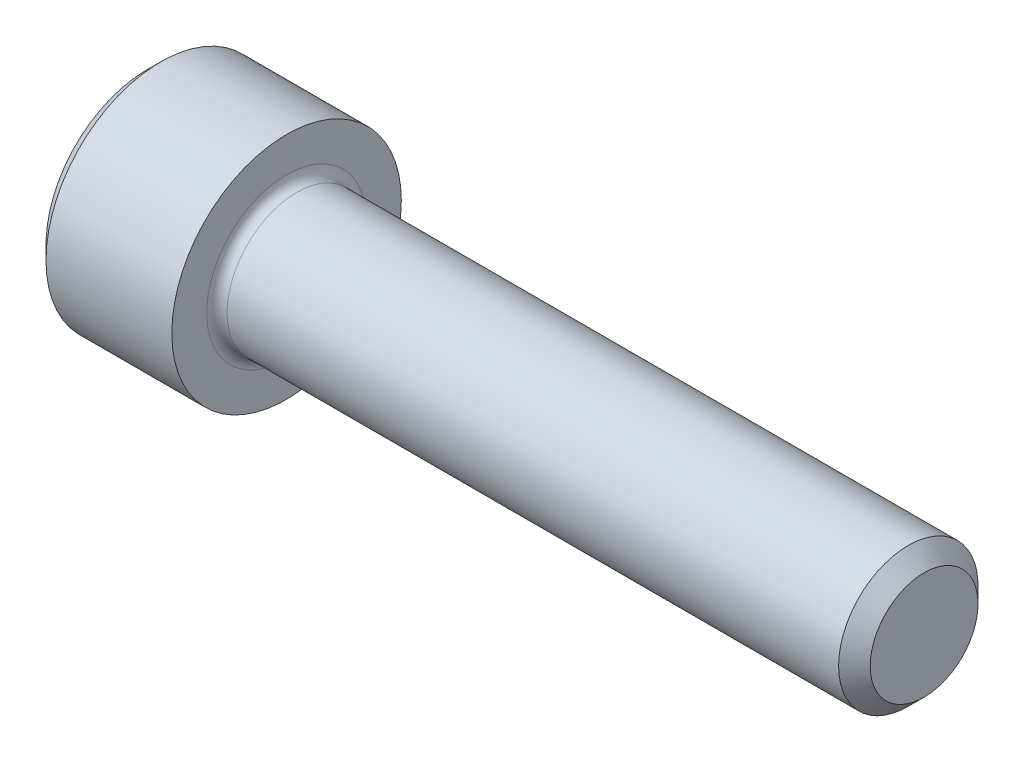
ISO-10303-21;
HEADER;
FILE_DESCRIPTION(('STEP AP214'),'2;1');
FILE_NAME('part.step','',(''),(''),'','','');
FILE_SCHEMA(('AUTOMOTIVE_DESIGN { 1 0 10303 214 1 1 1 1 }'));
ENDSEC;
DATA;
#1=APPLICATION_CONTEXT('core data for automotive mechanical design processes');
#2=APPLICATION_PROTOCOL_DEFINITION('international standard','automotive_design',2000,#1);
#3=PRODUCT_CONTEXT('',#1,'mechanical');
#4=PRODUCT('Part','Part','',(#3));
#5=PRODUCT_RELATED_PRODUCT_CATEGORY('part','',(#4));
#6=PRODUCT_DEFINITION_FORMATION('','',#4);
#7=PRODUCT_DEFINITION_CONTEXT('part definition',#1,'design');
#8=PRODUCT_DEFINITION('design','',#6,#7);
#9=PRODUCT_DEFINITION_SHAPE('','',#8);
#10=(LENGTH_UNIT() NAMED_UNIT(*) SI_UNIT(.MILLI.,.METRE.));
#11=(NAMED_UNIT(*) PLANE_ANGLE_UNIT() SI_UNIT($,.RADIAN.));
#12=(NAMED_UNIT(*) SI_UNIT($,.STERADIAN.) SOLID_ANGLE_UNIT());
#13=UNCERTAINTY_MEASURE_WITH_UNIT(LENGTH_MEASURE(1.E-05),#10,'distance_accuracy_value','');
#14=(GEOMETRIC_REPRESENTATION_CONTEXT(3) GLOBAL_UNCERTAINTY_ASSIGNED_CONTEXT((#13)) GLOBAL_UNIT_ASSIGNED_CONTEXT((#10,
#11,#12)) REPRESENTATION_CONTEXT('',''));
#15=CARTESIAN_POINT('',(0.,0.,0.));
#16=DIRECTION('',(0.,0.,1.));
#17=DIRECTION('',(1.,0.,0.));
#18=AXIS2_PLACEMENT_3D('',#15,#16,#17);
#19=CARTESIAN_POINT('',(0.,0.,0.));
#20=DIRECTION('',(-0.999999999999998,0.,0.));
#21=DIRECTION('',(0.,0.,0.999999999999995));
#22=AXIS2_PLACEMENT_3D('',#19,#20,#21);
#23=PLANE('',#22);
#24=DIRECTION('',(0.,-0.499999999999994,0.866025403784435));
#25=VECTOR('',#24,1.);
#26=CARTESIAN_POINT('',(0.,2.05305755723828,0.));
#27=LINE('',#26,#25);
#28=CARTESIAN_POINT('',(0.,2.05305755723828,0.));
#29=VERTEX_POINT('',#28);
#30=CARTESIAN_POINT('',(0.,1.02652877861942,1.77800000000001));
#31=VERTEX_POINT('',#30);
#32=EDGE_CURVE('E261',#29,#31,#27,.T.);
#33=ORIENTED_EDGE('',*,*,#32,.T.);
#34=DIRECTION('',(0.,0.999999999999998,0.));
#35=VECTOR('',#34,1.);
#36=CARTESIAN_POINT('',(0.,-1.02652877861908,1.77799999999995));
#37=LINE('',#36,#35);
#38=CARTESIAN_POINT('',(0.,-1.02652877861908,1.77799999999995));
#39=VERTEX_POINT('',#38);
#40=EDGE_CURVE('E132',#39,#31,#37,.T.);
#41=ORIENTED_EDGE('',*,*,#40,.F.);
#42=DIRECTION('',(0.,-0.500000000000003,-0.866025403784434));
#43=VECTOR('',#42,1.);
#44=CARTESIAN_POINT('',(0.,-1.02652877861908,1.77799999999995));
#45=LINE('',#44,#43);
#46=CARTESIAN_POINT('',(0.,-2.05305755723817,0.));
#47=VERTEX_POINT('',#46);
#48=EDGE_CURVE('E264',#39,#47,#45,.T.);
#49=ORIENTED_EDGE('',*,*,#48,.T.);
#50=DIRECTION('',(0.,0.499999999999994,-0.866025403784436));
#51=VECTOR('',#50,1.);
#52=CARTESIAN_POINT('',(0.,-2.05305755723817,0.));
#53=LINE('',#52,#51);
#54=CARTESIAN_POINT('',(0.,-1.02652877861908,-1.77799999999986));
#55=VERTEX_POINT('',#54);
#56=EDGE_CURVE('E267',#47,#55,#53,.T.);
#57=ORIENTED_EDGE('',*,*,#56,.T.);
#58=DIRECTION('',(0.,-1.,0.));
#59=VECTOR('',#58,1.);
#60=CARTESIAN_POINT('',(0.,1.02652877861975,-1.77799999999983));
#61=LINE('',#60,#59);
#62=CARTESIAN_POINT('',(0.,1.02652877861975,-1.77799999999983));
#63=VERTEX_POINT('',#62);
#64=EDGE_CURVE('E270',#63,#55,#61,.T.);
#65=ORIENTED_EDGE('',*,*,#64,.F.);
#66=DIRECTION('',(0.,-0.500000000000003,-0.866025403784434));
#67=VECTOR('',#66,1.);
#68=CARTESIAN_POINT('',(0.,2.05305755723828,0.));
#69=LINE('',#68,#67);
#70=EDGE_CURVE('E127',#29,#63,#69,.T.);
#71=ORIENTED_EDGE('',*,*,#70,.F.);
#72=EDGE_LOOP('',(#33,#41,#49,#57,#65,#71));
#73=FACE_BOUND('',#72,.T.);
#74=CARTESIAN_POINT('',(0.,0.,0.));
#75=DIRECTION('',(-0.999999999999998,0.,0.));
#76=DIRECTION('',(0.,0.,0.999999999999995));
#77=AXIS2_PLACEMENT_3D('',#74,#75,#76);
#78=CIRCLE('',#77,3.0226);
#79=CARTESIAN_POINT('',(0.,0.,-3.02259999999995));
#80=VERTEX_POINT('',#79);
#81=EDGE_CURVE('E156',#80,#80,#78,.T.);
#82=ORIENTED_EDGE('',*,*,#81,.T.);
#83=EDGE_LOOP('',(#82));
#84=FACE_BOUND('',#83,.T.);
#85=ADVANCED_FACE('F36',(#73,#84),#23,.T.);
#86=CARTESIAN_POINT('',(0.,0.,0.));
#87=DIRECTION('',(0.999999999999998,0.,0.));
#88=DIRECTION('',(0.,0.,-0.999999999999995));
#89=AXIS2_PLACEMENT_3D('',#86,#87,#88);
#90=CONICAL_SURFACE('',#89,3.0226,0.785398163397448);
#91=CARTESIAN_POINT('',(0.406400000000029,-1.11022302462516E-13,0.));
#92=DIRECTION('',(-0.999999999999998,0.,0.));
#93=DIRECTION('',(0.,0.,0.999999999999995));
#94=AXIS2_PLACEMENT_3D('',#91,#92,#93);
#95=CIRCLE('',#94,3.429);
#96=CARTESIAN_POINT('',(0.406400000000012,0.,-3.42899999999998));
#97=VERTEX_POINT('',#96);
#98=EDGE_CURVE('E153',#97,#97,#95,.T.);
#99=CARTESIAN_POINT('',(0.406400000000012,0.,-3.42899999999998));
#100=CARTESIAN_POINT('',(0.402166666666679,0.,-3.42476666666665));
#101=CARTESIAN_POINT('',(0.397933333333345,0.,-3.42053333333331));
#102=CARTESIAN_POINT('',(0.389466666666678,0.,-3.41206666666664));
#103=CARTESIAN_POINT('',(0.385233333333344,0.,-3.40783333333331));
#104=CARTESIAN_POINT('',(0.376766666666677,0.,-3.39936666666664));
#105=CARTESIAN_POINT('',(0.372533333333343,0.,-3.39513333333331));
#106=CARTESIAN_POINT('',(0.364066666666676,0.,-3.38666666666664));
#107=CARTESIAN_POINT('',(0.359833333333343,0.,-3.38243333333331));
#108=CARTESIAN_POINT('',(0.351366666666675,0.,-3.37396666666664));
#109=CARTESIAN_POINT('',(0.347133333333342,0.,-3.36973333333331));
#110=CARTESIAN_POINT('',(0.338666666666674,0.,-3.36126666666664));
#111=CARTESIAN_POINT('',(0.334433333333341,0.,-3.35703333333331));
#112=CARTESIAN_POINT('',(0.325966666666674,0.,-3.34856666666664));
#113=CARTESIAN_POINT('',(0.32173333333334,0.,-3.34433333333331));
#114=CARTESIAN_POINT('',(0.313266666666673,0.,-3.33586666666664));
#115=CARTESIAN_POINT('',(0.309033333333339,0.,-3.33163333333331));
#116=CARTESIAN_POINT('',(0.300566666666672,0.,-3.32316666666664));
#117=CARTESIAN_POINT('',(0.296333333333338,0.,-3.31893333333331));
#118=CARTESIAN_POINT('',(0.287866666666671,0.,-3.31046666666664));
#119=CARTESIAN_POINT('',(0.283633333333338,0.,-3.30623333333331));
#120=CARTESIAN_POINT('',(0.27516666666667,0.,-3.29776666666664));
#121=CARTESIAN_POINT('',(0.270933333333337,0.,-3.2935333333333));
#122=CARTESIAN_POINT('',(0.262466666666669,0.,-3.28506666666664));
#123=CARTESIAN_POINT('',(0.258233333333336,0.,-3.2808333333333));
#124=CARTESIAN_POINT('',(0.249766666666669,0.,-3.27236666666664));
#125=CARTESIAN_POINT('',(0.245533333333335,0.,-3.2681333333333));
#126=CARTESIAN_POINT('',(0.237066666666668,0.,-3.25966666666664));
#127=CARTESIAN_POINT('',(0.232833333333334,0.,-3.2554333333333));
#128=CARTESIAN_POINT('',(0.224366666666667,0.,-3.24696666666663));
#129=CARTESIAN_POINT('',(0.220133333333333,0.,-3.2427333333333));
#130=CARTESIAN_POINT('',(0.211666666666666,0.,-3.23426666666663));
#131=CARTESIAN_POINT('',(0.207433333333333,0.,-3.2300333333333));
#132=CARTESIAN_POINT('',(0.198966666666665,0.,-3.22156666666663));
#133=CARTESIAN_POINT('',(0.194733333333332,0.,-3.2173333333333));
#134=CARTESIAN_POINT('',(0.186266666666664,0.,-3.20886666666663));
#135=CARTESIAN_POINT('',(0.182033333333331,0.,-3.2046333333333));
#136=CARTESIAN_POINT('',(0.173566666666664,0.,-3.19616666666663));
#137=CARTESIAN_POINT('',(0.16933333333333,0.,-3.1919333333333));
#138=CARTESIAN_POINT('',(0.160866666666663,0.,-3.18346666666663));
#139=CARTESIAN_POINT('',(0.156633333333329,0.,-3.1792333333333));
#140=CARTESIAN_POINT('',(0.148166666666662,0.,-3.17076666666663));
#141=CARTESIAN_POINT('',(0.143933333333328,0.,-3.1665333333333));
#142=CARTESIAN_POINT('',(0.135466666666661,0.,-3.15806666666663));
#143=CARTESIAN_POINT('',(0.131233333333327,0.,-3.1538333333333));
#144=CARTESIAN_POINT('',(0.12276666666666,0.,-3.14536666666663));
#145=CARTESIAN_POINT('',(0.118533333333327,0.,-3.14113333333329));
#146=CARTESIAN_POINT('',(0.110066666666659,0.,-3.13266666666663));
#147=CARTESIAN_POINT('',(0.105833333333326,0.,-3.12843333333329));
#148=CARTESIAN_POINT('',(0.0973666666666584,0.,-3.11996666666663));
#149=CARTESIAN_POINT('',(0.0931333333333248,0.,-3.11573333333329));
#150=CARTESIAN_POINT('',(0.0846666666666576,0.,-3.10726666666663));
#151=CARTESIAN_POINT('',(0.080433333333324,0.,-3.10303333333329));
#152=CARTESIAN_POINT('',(0.0719666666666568,0.,-3.09456666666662));
#153=CARTESIAN_POINT('',(0.0677333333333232,0.,-3.09033333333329));
#154=CARTESIAN_POINT('',(0.0592666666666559,0.,-3.08186666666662));
#155=CARTESIAN_POINT('',(0.0550333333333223,0.,-3.07763333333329));
#156=CARTESIAN_POINT('',(0.0465666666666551,0.,-3.06916666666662));
#157=CARTESIAN_POINT('',(0.0423333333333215,0.,-3.06493333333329));
#158=CARTESIAN_POINT('',(0.0338666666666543,0.,-3.05646666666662));
#159=CARTESIAN_POINT('',(0.0296333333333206,0.,-3.05223333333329));
#160=CARTESIAN_POINT('',(0.0211666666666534,0.,-3.04376666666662));
#161=CARTESIAN_POINT('',(0.0169333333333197,0.,-3.03953333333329));
#162=CARTESIAN_POINT('',(0.00846666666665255,0.,-3.03106666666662));
#163=CARTESIAN_POINT('',(0.00423333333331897,0.,-3.02683333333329));
#164=CARTESIAN_POINT('',(0.,0.,-3.02259999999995));
#165=B_SPLINE_CURVE_WITH_KNOTS('',3,(#99,#100,#101,#102,#103,#104,#105,#106,#107,#108,#109,#110,
#111,#112,#113,#114,#115,#116,#117,#118,#119,#120,#121,#122,#123,#124,#125,#126,#127,#128,#129,
#130,#131,#132,#133,#134,#135,#136,#137,#138,#139,#140,#141,#142,#143,#144,#145,#146,#147,#148,
#149,#150,#151,#152,#153,#154,#155,#156,#157,#158,#159,#160,#161,#162,#163,#164),.UNSPECIFIED.,
.F.,.F.,(4,2,2,2,2,2,2,2,2,2,2,2,2,2,2,2,2,2,2,2,2,2,2,2,2,2,2,2,2,2,2,2,4),(0.,
0.0179605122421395,0.0359210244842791,0.0538815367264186,0.0718420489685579,0.0898025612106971,
0.107763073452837,0.125723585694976,0.143684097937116,0.161644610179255,0.179605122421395,
0.197565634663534,0.215526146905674,0.233486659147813,0.251447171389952,0.269407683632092,
0.287368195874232,0.305328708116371,0.32328922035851,0.34124973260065,0.359210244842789,
0.377170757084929,0.395131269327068,0.413091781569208,0.431052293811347,0.449012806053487,
0.466973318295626,0.484933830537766,0.502894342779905,0.520854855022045,0.538815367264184,
0.556775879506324,0.574736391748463),.UNSPECIFIED.);
#166=EDGE_CURVE('BSEAM177',#97,#80,#165,.T.);
#167=ORIENTED_EDGE('',*,*,#98,.T.);
#168=ORIENTED_EDGE('',*,*,#81,.F.);
#169=ORIENTED_EDGE('',*,*,#166,.T.);
#170=ORIENTED_EDGE('',*,*,#166,.F.);
#171=EDGE_LOOP('',(#167,#169,#168,#170));
#172=FACE_BOUND('',#171,.T.);
#173=ADVANCED_FACE('F177',(#172),#90,.T.);
#174=CARTESIAN_POINT('',(-31.7499999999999,-2.18575157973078E-13,0.));
#175=DIRECTION('',(-0.999999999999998,0.,0.));
#176=DIRECTION('',(0.,0.,0.999999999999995));
#177=AXIS2_PLACEMENT_3D('',#174,#175,#176);
#178=CYLINDRICAL_SURFACE('',#177,3.429);
#179=CARTESIAN_POINT('',(4.16559999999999,-1.12757025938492E-13,-1.83880688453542E-13));
#180=DIRECTION('',(-0.999999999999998,0.,0.));
#181=DIRECTION('',(0.,0.,0.999999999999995));
#182=AXIS2_PLACEMENT_3D('',#179,#180,#181);
#183=CIRCLE('',#182,3.429);
#184=CARTESIAN_POINT('',(4.16559999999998,-1.08188680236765E-13,3.4289999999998));
#185=VERTEX_POINT('',#184);
#186=EDGE_CURVE('E150',#185,#185,#183,.T.);
#187=ORIENTED_EDGE('',*,*,#186,.T.);
#188=EDGE_LOOP('',(#187));
#189=FACE_BOUND('',#188,.T.);
#190=ORIENTED_EDGE('',*,*,#98,.F.);
#191=EDGE_LOOP('',(#190));
#192=FACE_BOUND('',#191,.T.);
#193=ADVANCED_FACE('F182',(#189,#192),#178,.T.);
#194=CARTESIAN_POINT('',(4.16559999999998,3.42900000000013,-1.31838984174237E-13));
#195=DIRECTION('',(0.999999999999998,0.,0.));
#196=DIRECTION('',(0.,0.,-0.999999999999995));
#197=AXIS2_PLACEMENT_3D('',#194,#195,#196);
#198=PLANE('',#197);
#199=CARTESIAN_POINT('',(4.16559999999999,-1.12757025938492E-13,-1.83880688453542E-13));
#200=DIRECTION('',(0.999999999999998,0.,0.));
#201=DIRECTION('',(0.,0.,-0.999999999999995));
#202=AXIS2_PLACEMENT_3D('',#199,#200,#201);
#203=CIRCLE('',#202,2.38759999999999);
#204=CARTESIAN_POINT('',(4.1656,-1.15937948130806E-13,-2.38760000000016));
#205=VERTEX_POINT('',#204);
#206=EDGE_CURVE('E44',#205,#205,#203,.F.);
#207=ORIENTED_EDGE('',*,*,#206,.T.);
#208=EDGE_LOOP('',(#207));
#209=FACE_BOUND('',#208,.T.);
#210=ORIENTED_EDGE('',*,*,#186,.F.);
#211=EDGE_LOOP('',(#210));
#212=FACE_BOUND('',#211,.T.);
#213=ADVANCED_FACE('F161',(#209,#212),#198,.T.);
#214=CARTESIAN_POINT('',(-31.7499999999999,-2.18575157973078E-13,0.));
#215=DIRECTION('',(-0.999999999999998,0.,0.));
#216=DIRECTION('',(0.,0.,0.999999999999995));
#217=AXIS2_PLACEMENT_3D('',#214,#215,#216);
#218=CYLINDRICAL_SURFACE('',#217,2.08279999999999);
#219=CARTESIAN_POINT('',(4.47039999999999,0.,-1.66533453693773E-13));
#220=DIRECTION('',(0.999999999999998,0.,0.));
#221=DIRECTION('',(0.,0.,-0.999999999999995));
#222=AXIS2_PLACEMENT_3D('',#219,#220,#221);
#223=CIRCLE('',#222,2.08279999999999);
#224=CARTESIAN_POINT('',(4.47039999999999,-4.19915949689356E-13,2.08279999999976));
#225=VERTEX_POINT('',#224);
#226=EDGE_CURVE('E11',#225,#225,#223,.T.);
#227=CARTESIAN_POINT('',(22.74316,1.05818132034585E-13,-2.77555756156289E-13));
#228=DIRECTION('',(-0.999999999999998,0.,0.));
#229=DIRECTION('',(0.,0.,0.999999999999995));
#230=AXIS2_PLACEMENT_3D('',#227,#228,#229);
#231=CIRCLE('',#230,2.08279999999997);
#232=CARTESIAN_POINT('',(22.74316,-5.22889856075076E-13,2.08279999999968));
#233=VERTEX_POINT('',#232);
#234=EDGE_CURVE('E147',#233,#233,#231,.T.);
#235=CARTESIAN_POINT('',(4.47039999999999,-4.19915949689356E-13,2.08279999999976));
#236=CARTESIAN_POINT('',(4.66074124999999,-4.20988594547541E-13,2.08279999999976));
#237=CARTESIAN_POINT('',(4.85108249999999,-4.22061239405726E-13,2.08279999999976));
#238=CARTESIAN_POINT('',(5.23176499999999,-4.24206529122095E-13,2.08279999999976));
#239=CARTESIAN_POINT('',(5.42210624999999,-4.25279173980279E-13,2.08279999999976));
#240=CARTESIAN_POINT('',(5.80278874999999,-4.27424463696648E-13,2.08279999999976));
#241=CARTESIAN_POINT('',(5.99312999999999,-4.28497108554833E-13,2.08279999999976));
#242=CARTESIAN_POINT('',(6.37381249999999,-4.30642398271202E-13,2.08279999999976));
#243=CARTESIAN_POINT('',(6.56415374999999,-4.31715043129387E-13,2.08279999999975));
#244=CARTESIAN_POINT('',(6.94483624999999,-4.33860332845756E-13,2.08279999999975));
#245=CARTESIAN_POINT('',(7.13517749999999,-4.3493297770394E-13,2.08279999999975));
#246=CARTESIAN_POINT('',(7.51585999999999,-4.3707826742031E-13,2.08279999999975));
#247=CARTESIAN_POINT('',(7.70620124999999,-4.38150912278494E-13,2.08279999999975));
#248=CARTESIAN_POINT('',(8.08688374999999,-4.40296201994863E-13,2.08279999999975));
#249=CARTESIAN_POINT('',(8.27722499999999,-4.41368846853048E-13,2.08279999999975));
#250=CARTESIAN_POINT('',(8.65790749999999,-4.43514136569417E-13,2.08279999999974));
#251=CARTESIAN_POINT('',(8.84824874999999,-4.44586781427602E-13,2.08279999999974));
#252=CARTESIAN_POINT('',(9.22893124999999,-4.46732071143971E-13,2.08279999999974));
#253=CARTESIAN_POINT('',(9.41927249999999,-4.47804716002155E-13,2.08279999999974));
#254=CARTESIAN_POINT('',(9.79995499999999,-4.49950005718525E-13,2.08279999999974));
#255=CARTESIAN_POINT('',(9.99029624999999,-4.51022650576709E-13,2.08279999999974));
#256=CARTESIAN_POINT('',(10.37097875,-4.53167940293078E-13,2.08279999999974));
#257=CARTESIAN_POINT('',(10.56132,-4.54240585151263E-13,2.08279999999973));
#258=CARTESIAN_POINT('',(10.9420025,-4.56385874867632E-13,2.08279999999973));
#259=CARTESIAN_POINT('',(11.13234375,-4.57458519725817E-13,2.08279999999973));
#260=CARTESIAN_POINT('',(11.51302625,-4.59603809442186E-13,2.08279999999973));
#261=CARTESIAN_POINT('',(11.7033675,-4.6067645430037E-13,2.08279999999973));
#262=CARTESIAN_POINT('',(12.08405,-4.62821744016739E-13,2.08279999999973));
#263=CARTESIAN_POINT('',(12.27439125,-4.63894388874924E-13,2.08279999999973));
#264=CARTESIAN_POINT('',(12.65507375,-4.66039678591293E-13,2.08279999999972));
#265=CARTESIAN_POINT('',(12.845415,-4.67112323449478E-13,2.08279999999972));
#266=CARTESIAN_POINT('',(13.2260975,-4.69257613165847E-13,2.08279999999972));
#267=CARTESIAN_POINT('',(13.41643875,-4.70330258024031E-13,2.08279999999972));
#268=CARTESIAN_POINT('',(13.79712125,-4.724755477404E-13,2.08279999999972));
#269=CARTESIAN_POINT('',(13.9874625,-4.73548192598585E-13,2.08279999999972));
#270=CARTESIAN_POINT('',(14.368145,-4.75693482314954E-13,2.08279999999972));
#271=CARTESIAN_POINT('',(14.55848625,-4.76766127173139E-13,2.08279999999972));
#272=CARTESIAN_POINT('',(14.93916875,-4.78911416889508E-13,2.08279999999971));
#273=CARTESIAN_POINT('',(15.12951,-4.79984061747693E-13,2.08279999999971));
#274=CARTESIAN_POINT('',(15.5101925,-4.82129351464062E-13,2.08279999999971));
#275=CARTESIAN_POINT('',(15.70053375,-4.83201996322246E-13,2.08279999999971));
#276=CARTESIAN_POINT('',(16.08121625,-4.85347286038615E-13,2.08279999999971));
#277=CARTESIAN_POINT('',(16.2715575,-4.864199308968E-13,2.08279999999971));
#278=CARTESIAN_POINT('',(16.65224,-4.88565220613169E-13,2.08279999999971));
#279=CARTESIAN_POINT('',(16.84258125,-4.89637865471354E-13,2.0827999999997));
#280=CARTESIAN_POINT('',(17.22326375,-4.91783155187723E-13,2.0827999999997));
#281=CARTESIAN_POINT('',(17.413605,-4.92855800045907E-13,2.0827999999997));
#282=CARTESIAN_POINT('',(17.7942875,-4.95001089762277E-13,2.0827999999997));
#283=CARTESIAN_POINT('',(17.98462875,-4.96073734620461E-13,2.0827999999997));
#284=CARTESIAN_POINT('',(18.36531125,-4.9821902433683E-13,2.0827999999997));
#285=CARTESIAN_POINT('',(18.5556525,-4.99291669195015E-13,2.0827999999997));
#286=CARTESIAN_POINT('',(18.936335,-5.01436958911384E-13,2.08279999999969));
#287=CARTESIAN_POINT('',(19.12667625,-5.02509603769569E-13,2.08279999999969));
#288=CARTESIAN_POINT('',(19.50735875,-5.04654893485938E-13,2.08279999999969));
#289=CARTESIAN_POINT('',(19.6977,-5.05727538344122E-13,2.08279999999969));
#290=CARTESIAN_POINT('',(20.0783825,-5.07872828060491E-13,2.08279999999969));
#291=CARTESIAN_POINT('',(20.26872375,-5.08945472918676E-13,2.08279999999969));
#292=CARTESIAN_POINT('',(20.64940625,-5.11090762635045E-13,2.08279999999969));
#293=CARTESIAN_POINT('',(20.8397475,-5.1216340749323E-13,2.08279999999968));
#294=CARTESIAN_POINT('',(21.22043,-5.14308697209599E-13,2.08279999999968));
#295=CARTESIAN_POINT('',(21.41077125,-5.15381342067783E-13,2.08279999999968));
#296=CARTESIAN_POINT('',(21.79145375,-5.17526631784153E-13,2.08279999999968));
#297=CARTESIAN_POINT('',(21.981795,-5.18599276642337E-13,2.08279999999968));
#298=CARTESIAN_POINT('',(22.3624775,-5.20744566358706E-13,2.08279999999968));
#299=CARTESIAN_POINT('',(22.55281875,-5.21817211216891E-13,2.08279999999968));
#300=CARTESIAN_POINT('',(22.74316,-5.22889856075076E-13,2.08279999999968));
#301=B_SPLINE_CURVE_WITH_KNOTS('',3,(#235,#236,#237,#238,#239,#240,#241,#242,#243,#244,#245,
#246,#247,#248,#249,#250,#251,#252,#253,#254,#255,#256,#257,#258,#259,#260,#261,#262,#263,#264,
#265,#266,#267,#268,#269,#270,#271,#272,#273,#274,#275,#276,#277,#278,#279,#280,#281,#282,#283,
#284,#285,#286,#287,#288,#289,#290,#291,#292,#293,#294,#295,#296,#297,#298,#299,#300),
.UNSPECIFIED.,.F.,.F.,(4,2,2,2,2,2,2,2,2,2,2,2,2,2,2,2,2,2,2,2,2,2,2,2,2,2,2,2,2,2,2,2,4),(0.,
0.571023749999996,1.14204749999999,1.71307125,2.284095,2.85511875,3.4261425,3.99716625,4.56819,
5.13921375,5.7102375,6.28126125,6.852285,7.42330875,7.9943325,8.56535625,9.13638,9.70740375,
10.2784275,10.84945125,11.420475,11.99149875,12.5625225,13.13354625,13.70457,14.27559375,
14.8466175,15.41764125,15.988665,16.55968875,17.1307125,17.70173625,18.27276),.UNSPECIFIED.);
#302=EDGE_CURVE('BSEAM192',#225,#233,#301,.T.);
#303=ORIENTED_EDGE('',*,*,#226,.T.);
#304=ORIENTED_EDGE('',*,*,#234,.T.);
#305=ORIENTED_EDGE('',*,*,#302,.T.);
#306=ORIENTED_EDGE('',*,*,#302,.F.);
#307=EDGE_LOOP('',(#303,#305,#304,#306));
#308=FACE_BOUND('',#307,.T.);
#309=ADVANCED_FACE('F192',(#308),#218,.T.);
#310=CARTESIAN_POINT('',(23.2156,-3.36536354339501E-13,-1.90819582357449E-13));
#311=DIRECTION('',(-0.999999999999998,0.,0.));
#312=DIRECTION('',(0.,0.,0.999999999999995));
#313=AXIS2_PLACEMENT_3D('',#310,#311,#312);
#314=CONICAL_SURFACE('',#313,1.61036,0.785398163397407);
#315=CARTESIAN_POINT('',(23.2156,-3.36536354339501E-13,-1.90819582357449E-13));
#316=DIRECTION('',(-0.999999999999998,0.,0.));
#317=DIRECTION('',(0.,0.,0.999999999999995));
#318=AXIS2_PLACEMENT_3D('',#315,#316,#317);
#319=CIRCLE('',#318,1.61036);
#320=CARTESIAN_POINT('',(23.2156,-3.34390923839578E-13,1.61035999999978));
#321=VERTEX_POINT('',#320);
#322=EDGE_CURVE('E143',#321,#321,#319,.T.);
#323=CARTESIAN_POINT('',(22.74316,-3.31099129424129E-13,2.08279999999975));
#324=CARTESIAN_POINT('',(22.74808125,-3.3113341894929E-13,2.07787874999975));
#325=CARTESIAN_POINT('',(22.7530025,-3.31167708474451E-13,2.07295749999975));
#326=CARTESIAN_POINT('',(22.762845,-3.31236287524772E-13,2.06311499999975));
#327=CARTESIAN_POINT('',(22.76776625,-3.31270577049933E-13,2.05819374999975));
#328=CARTESIAN_POINT('',(22.77760875,-3.31339156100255E-13,2.04835124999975));
#329=CARTESIAN_POINT('',(22.78253,-3.31373445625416E-13,2.04342999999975));
#330=CARTESIAN_POINT('',(22.7923725,-3.31442024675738E-13,2.03358749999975));
#331=CARTESIAN_POINT('',(22.79729375,-3.31476314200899E-13,2.02866624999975));
#332=CARTESIAN_POINT('',(22.80713625,-3.31544893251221E-13,2.01882374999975));
#333=CARTESIAN_POINT('',(22.8120575,-3.31579182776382E-13,2.01390249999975));
#334=CARTESIAN_POINT('',(22.8219,-3.31647761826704E-13,2.00405999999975));
#335=CARTESIAN_POINT('',(22.82682125,-3.31682051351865E-13,1.99913874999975));
#336=CARTESIAN_POINT('',(22.83666375,-3.31750630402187E-13,1.98929624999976));
#337=CARTESIAN_POINT('',(22.841585,-3.31784919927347E-13,1.98437499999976));
#338=CARTESIAN_POINT('',(22.8514275,-3.31853498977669E-13,1.97453249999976));
#339=CARTESIAN_POINT('',(22.85634875,-3.3188778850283E-13,1.96961124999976));
#340=CARTESIAN_POINT('',(22.86619125,-3.31956367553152E-13,1.95976874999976));
#341=CARTESIAN_POINT('',(22.8711125,-3.31990657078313E-13,1.95484749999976));
#342=CARTESIAN_POINT('',(22.880955,-3.32059236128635E-13,1.94500499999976));
#343=CARTESIAN_POINT('',(22.88587625,-3.32093525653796E-13,1.94008374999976));
#344=CARTESIAN_POINT('',(22.89571875,-3.32162104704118E-13,1.93024124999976));
#345=CARTESIAN_POINT('',(22.90064,-3.32196394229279E-13,1.92531999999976));
#346=CARTESIAN_POINT('',(22.9104825,-3.322649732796E-13,1.91547749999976));
#347=CARTESIAN_POINT('',(22.91540375,-3.32299262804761E-13,1.91055624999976));
#348=CARTESIAN_POINT('',(22.92524625,-3.32367841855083E-13,1.90071374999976));
#349=CARTESIAN_POINT('',(22.9301675,-3.32402131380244E-13,1.89579249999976));
#350=CARTESIAN_POINT('',(22.94001,-3.32470710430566E-13,1.88594999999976));
#351=CARTESIAN_POINT('',(22.94493125,-3.32504999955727E-13,1.88102874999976));
#352=CARTESIAN_POINT('',(22.95477375,-3.32573579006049E-13,1.87118624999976));
#353=CARTESIAN_POINT('',(22.959695,-3.3260786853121E-13,1.86626499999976));
#354=CARTESIAN_POINT('',(22.9695375,-3.32676447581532E-13,1.85642249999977));
#355=CARTESIAN_POINT('',(22.97445875,-3.32710737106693E-13,1.85150124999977));
#356=CARTESIAN_POINT('',(22.98430125,-3.32779316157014E-13,1.84165874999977));
#357=CARTESIAN_POINT('',(22.9892225,-3.32813605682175E-13,1.83673749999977));
#358=CARTESIAN_POINT('',(22.999065,-3.32882184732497E-13,1.82689499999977));
#359=CARTESIAN_POINT('',(23.00398625,-3.32916474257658E-13,1.82197374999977));
#360=CARTESIAN_POINT('',(23.01382875,-3.3298505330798E-13,1.81213124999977));
#361=CARTESIAN_POINT('',(23.01875,-3.33019342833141E-13,1.80720999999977));
#362=CARTESIAN_POINT('',(23.0285925,-3.33087921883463E-13,1.79736749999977));
#363=CARTESIAN_POINT('',(23.03351375,-3.33122211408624E-13,1.79244624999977));
#364=CARTESIAN_POINT('',(23.04335625,-3.33190790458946E-13,1.78260374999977));
#365=CARTESIAN_POINT('',(23.0482775,-3.33225079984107E-13,1.77768249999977));
#366=CARTESIAN_POINT('',(23.05812,-3.33293659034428E-13,1.76783999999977));
#367=CARTESIAN_POINT('',(23.06304125,-3.33327948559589E-13,1.76291874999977));
#368=CARTESIAN_POINT('',(23.07288375,-3.33396527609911E-13,1.75307624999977));
#369=CARTESIAN_POINT('',(23.077805,-3.33430817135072E-13,1.74815499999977));
#370=CARTESIAN_POINT('',(23.0876475,-3.33499396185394E-13,1.73831249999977));
#371=CARTESIAN_POINT('',(23.09256875,-3.33533685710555E-13,1.73339124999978));
#372=CARTESIAN_POINT('',(23.10241125,-3.33602264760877E-13,1.72354874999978));
#373=CARTESIAN_POINT('',(23.1073325,-3.33636554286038E-13,1.71862749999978));
#374=CARTESIAN_POINT('',(23.117175,-3.3370513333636E-13,1.70878499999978));
#375=CARTESIAN_POINT('',(23.12209625,-3.3373942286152E-13,1.70386374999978));
#376=CARTESIAN_POINT('',(23.13193875,-3.33808001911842E-13,1.69402124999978));
#377=CARTESIAN_POINT('',(23.13686,-3.33842291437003E-13,1.68909999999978));
#378=CARTESIAN_POINT('',(23.1467025,-3.33910870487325E-13,1.67925749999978));
#379=CARTESIAN_POINT('',(23.15162375,-3.33945160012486E-13,1.67433624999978));
#380=CARTESIAN_POINT('',(23.16146625,-3.34013739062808E-13,1.66449374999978));
#381=CARTESIAN_POINT('',(23.1663875,-3.34048028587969E-13,1.65957249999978));
#382=CARTESIAN_POINT('',(23.17623,-3.34116607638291E-13,1.64972999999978));
#383=CARTESIAN_POINT('',(23.18115125,-3.34150897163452E-13,1.64480874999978));
#384=CARTESIAN_POINT('',(23.19099375,-3.34219476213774E-13,1.63496624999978));
#385=CARTESIAN_POINT('',(23.195915,-3.34253765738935E-13,1.63004499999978));
#386=CARTESIAN_POINT('',(23.2057575,-3.34322344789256E-13,1.62020249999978));
#387=CARTESIAN_POINT('',(23.21067875,-3.34356634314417E-13,1.61528124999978));
#388=CARTESIAN_POINT('',(23.2156,-3.34390923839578E-13,1.61035999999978));
#389=B_SPLINE_CURVE_WITH_KNOTS('',3,(#323,#324,#325,#326,#327,#328,#329,#330,#331,#332,#333,
#334,#335,#336,#337,#338,#339,#340,#341,#342,#343,#344,#345,#346,#347,#348,#349,#350,#351,#352,
#353,#354,#355,#356,#357,#358,#359,#360,#361,#362,#363,#364,#365,#366,#367,#368,#369,#370,#371,
#372,#373,#374,#375,#376,#377,#378,#379,#380,#381,#382,#383,#384,#385,#386,#387,#388),
.UNSPECIFIED.,.F.,.F.,(4,2,2,2,2,2,2,2,2,2,2,2,2,2,2,2,2,2,2,2,2,2,2,2,2,2,2,2,2,2,2,2,4),(0.,
0.0208790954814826,0.041758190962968,0.0626372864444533,0.0835163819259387,0.104395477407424,
0.12527457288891,0.146153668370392,0.167032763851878,0.187911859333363,0.208790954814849,
0.229670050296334,0.250549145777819,0.271428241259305,0.29230733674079,0.313186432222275,
0.334065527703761,0.354944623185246,0.375823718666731,0.396702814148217,0.4175819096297,
0.438461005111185,0.45934010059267,0.480219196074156,0.501098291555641,0.521977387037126,
0.542856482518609,0.563735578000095,0.58461467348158,0.605493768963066,0.626372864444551,
0.647251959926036,0.668131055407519),.UNSPECIFIED.);
#390=EDGE_CURVE('BSEAM172',#233,#321,#389,.T.);
#391=ORIENTED_EDGE('',*,*,#234,.F.);
#392=ORIENTED_EDGE('',*,*,#322,.T.);
#393=ORIENTED_EDGE('',*,*,#390,.T.);
#394=ORIENTED_EDGE('',*,*,#390,.F.);
#395=EDGE_LOOP('',(#391,#393,#392,#394));
#396=FACE_BOUND('',#395,.T.);
#397=ADVANCED_FACE('F172',(#396),#314,.T.);
#398=CARTESIAN_POINT('',(23.2156,1.61036000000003,-1.38777878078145E-13));
#399=DIRECTION('',(0.999999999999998,0.,0.));
#400=DIRECTION('',(0.,0.,-0.999999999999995));
#401=AXIS2_PLACEMENT_3D('',#398,#399,#400);
#402=PLANE('',#401);
#403=ORIENTED_EDGE('',*,*,#322,.F.);
#404=EDGE_LOOP('',(#403));
#405=FACE_BOUND('',#404,.T.);
#406=ADVANCED_FACE('F165',(#405),#402,.T.);
#407=CARTESIAN_POINT('',(4.47039999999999,0.,-1.66533453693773E-13));
#408=DIRECTION('',(0.999999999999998,0.,0.));
#409=DIRECTION('',(0.,0.,-0.999999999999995));
#410=AXIS2_PLACEMENT_3D('',#407,#408,#409);
#411=TOROIDAL_SURFACE('',#410,2.38759999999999,0.3048);
#412=ORIENTED_EDGE('',*,*,#226,.F.);
#413=EDGE_LOOP('',(#412));
#414=FACE_BOUND('',#413,.T.);
#415=ORIENTED_EDGE('',*,*,#206,.F.);
#416=EDGE_LOOP('',(#415));
#417=FACE_BOUND('',#416,.T.);
#418=ADVANCED_FACE('F38',(#414,#417),#411,.F.);
#419=CARTESIAN_POINT('',(1.95579999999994,2.05305755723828,0.));
#420=DIRECTION('',(0.,-0.866025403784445,-0.499999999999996));
#421=DIRECTION('',(0.,0.499999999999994,-0.866025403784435));
#422=AXIS2_PLACEMENT_3D('',#419,#420,#421);
#423=PLANE('',#422);
#424=ORIENTED_EDGE('',*,*,#32,.F.);
#425=DIRECTION('',(-0.999999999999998,0.,0.));
#426=VECTOR('',#425,1.);
#427=CARTESIAN_POINT('',(1.95579999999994,2.05305755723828,0.));
#428=LINE('',#427,#426);
#429=CARTESIAN_POINT('',(1.95579999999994,2.05305755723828,0.));
#430=VERTEX_POINT('',#429);
#431=EDGE_CURVE('E251',#430,#29,#428,.T.);
#432=ORIENTED_EDGE('',*,*,#431,.F.);
#433=DIRECTION('',(0.,-0.499999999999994,0.866025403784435));
#434=VECTOR('',#433,1.);
#435=CARTESIAN_POINT('',(1.95579999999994,2.05305755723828,0.));
#436=LINE('',#435,#434);
#437=CARTESIAN_POINT('',(1.95579999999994,1.53979316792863,0.889000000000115));
#438=VERTEX_POINT('',#437);
#439=EDGE_CURVE('E119',#430,#438,#436,.T.);
#440=ORIENTED_EDGE('',*,*,#439,.T.);
#441=CARTESIAN_POINT('',(1.95579999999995,1.02652877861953,1.77800000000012));
#442=VERTEX_POINT('',#441);
#443=EDGE_CURVE('E110',#438,#442,#436,.T.);
#444=ORIENTED_EDGE('',*,*,#443,.T.);
#445=DIRECTION('',(-0.999999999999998,0.,0.));
#446=VECTOR('',#445,1.);
#447=CARTESIAN_POINT('',(1.95579999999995,1.02652877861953,1.77800000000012));
#448=LINE('',#447,#446);
#449=EDGE_CURVE('E124',#442,#31,#448,.T.);
#450=ORIENTED_EDGE('',*,*,#449,.T.);
#451=EDGE_LOOP('',(#424,#432,#440,#444,#450));
#452=FACE_BOUND('',#451,.T.);
#453=ADVANCED_FACE('F123',(#452),#423,.T.);
#454=CARTESIAN_POINT('',(1.95579999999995,-1.0265287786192,1.77799999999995));
#455=DIRECTION('',(0.,0.,0.999999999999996));
#456=DIRECTION('',(0.,-0.999999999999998,0.));
#457=AXIS2_PLACEMENT_3D('',#454,#455,#456);
#458=PLANE('',#457);
#459=ORIENTED_EDGE('',*,*,#40,.T.);
#460=ORIENTED_EDGE('',*,*,#449,.F.);
#461=DIRECTION('',(0.,0.999999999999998,0.));
#462=VECTOR('',#461,1.);
#463=CARTESIAN_POINT('',(1.95579999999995,-1.0265287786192,1.77799999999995));
#464=LINE('',#463,#462);
#465=CARTESIAN_POINT('',(1.95580000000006,0.,1.77800000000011));
#466=VERTEX_POINT('',#465);
#467=EDGE_CURVE('E107',#466,#442,#464,.T.);
#468=ORIENTED_EDGE('',*,*,#467,.F.);
#469=CARTESIAN_POINT('',(1.95579999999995,-1.0265287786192,1.77799999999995));
#470=VERTEX_POINT('',#469);
#471=EDGE_CURVE('E118',#470,#466,#464,.T.);
#472=ORIENTED_EDGE('',*,*,#471,.F.);
#473=DIRECTION('',(-0.999999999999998,0.,0.));
#474=VECTOR('',#473,1.);
#475=CARTESIAN_POINT('',(1.95579999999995,-1.0265287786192,1.77799999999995));
#476=LINE('',#475,#474);
#477=EDGE_CURVE('E134',#470,#39,#476,.T.);
#478=ORIENTED_EDGE('',*,*,#477,.T.);
#479=EDGE_LOOP('',(#459,#460,#468,#472,#478));
#480=FACE_BOUND('',#479,.T.);
#481=ADVANCED_FACE('F129',(#480),#458,.F.);
#482=CARTESIAN_POINT('',(1.95579999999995,-1.0265287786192,1.77799999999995));
#483=DIRECTION('',(0.,0.866025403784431,-0.499999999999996));
#484=DIRECTION('',(0.,0.500000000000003,0.866025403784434));
#485=AXIS2_PLACEMENT_3D('',#482,#483,#484);
#486=PLANE('',#485);
#487=ORIENTED_EDGE('',*,*,#48,.F.);
#488=ORIENTED_EDGE('',*,*,#477,.F.);
#489=DIRECTION('',(0.,-0.500000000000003,-0.866025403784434));
#490=VECTOR('',#489,1.);
#491=CARTESIAN_POINT('',(1.95579999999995,-1.0265287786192,1.77799999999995));
#492=LINE('',#491,#490);
#493=CARTESIAN_POINT('',(1.95579999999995,-1.53979316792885,0.889000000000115));
#494=VERTEX_POINT('',#493);
#495=EDGE_CURVE('E290',#470,#494,#492,.T.);
#496=ORIENTED_EDGE('',*,*,#495,.T.);
#497=CARTESIAN_POINT('',(1.95579999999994,-2.05305755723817,0.));
#498=VERTEX_POINT('',#497);
#499=EDGE_CURVE('E279',#494,#498,#492,.T.);
#500=ORIENTED_EDGE('',*,*,#499,.T.);
#501=DIRECTION('',(-0.999999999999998,0.,0.));
#502=VECTOR('',#501,1.);
#503=CARTESIAN_POINT('',(1.95579999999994,-2.05305755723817,0.));
#504=LINE('',#503,#502);
#505=EDGE_CURVE('E139',#498,#47,#504,.T.);
#506=ORIENTED_EDGE('',*,*,#505,.T.);
#507=EDGE_LOOP('',(#487,#488,#496,#500,#506));
#508=FACE_BOUND('',#507,.T.);
#509=ADVANCED_FACE('F205',(#508),#486,.T.);
#510=CARTESIAN_POINT('',(1.95579999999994,-2.05305755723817,0.));
#511=DIRECTION('',(0.,0.866025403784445,0.499999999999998));
#512=DIRECTION('',(0.,-0.499999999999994,0.866025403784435));
#513=AXIS2_PLACEMENT_3D('',#510,#511,#512);
#514=PLANE('',#513);
#515=ORIENTED_EDGE('',*,*,#56,.F.);
#516=ORIENTED_EDGE('',*,*,#505,.F.);
#517=DIRECTION('',(0.,0.499999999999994,-0.866025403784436));
#518=VECTOR('',#517,1.);
#519=CARTESIAN_POINT('',(1.95579999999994,-2.05305755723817,0.));
#520=LINE('',#519,#518);
#521=CARTESIAN_POINT('',(1.95579999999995,-1.53979316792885,-0.889000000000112));
#522=VERTEX_POINT('',#521);
#523=EDGE_CURVE('E257',#498,#522,#520,.T.);
#524=ORIENTED_EDGE('',*,*,#523,.T.);
#525=CARTESIAN_POINT('',(1.95579999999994,-1.02652877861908,-1.77799999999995));
#526=VERTEX_POINT('',#525);
#527=EDGE_CURVE('E289',#522,#526,#520,.T.);
#528=ORIENTED_EDGE('',*,*,#527,.T.);
#529=DIRECTION('',(-0.999999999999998,0.,0.));
#530=VECTOR('',#529,1.);
#531=CARTESIAN_POINT('',(1.95579999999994,-1.02652877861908,-1.77799999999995));
#532=LINE('',#531,#530);
#533=EDGE_CURVE('E250',#526,#55,#532,.T.);
#534=ORIENTED_EDGE('',*,*,#533,.T.);
#535=EDGE_LOOP('',(#515,#516,#524,#528,#534));
#536=FACE_BOUND('',#535,.T.);
#537=ADVANCED_FACE('F208',(#536),#514,.T.);
#538=CARTESIAN_POINT('',(1.95579999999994,1.0265287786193,-1.77799999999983));
#539=DIRECTION('',(0.,0.,-0.999999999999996));
#540=DIRECTION('',(0.,1.,0.));
#541=AXIS2_PLACEMENT_3D('',#538,#539,#540);
#542=PLANE('',#541);
#543=ORIENTED_EDGE('',*,*,#64,.T.);
#544=ORIENTED_EDGE('',*,*,#533,.F.);
#545=DIRECTION('',(0.,-1.,0.));
#546=VECTOR('',#545,1.);
#547=CARTESIAN_POINT('',(1.95579999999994,1.0265287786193,-1.77799999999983));
#548=LINE('',#547,#546);
#549=CARTESIAN_POINT('',(1.95579999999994,-2.23779328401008E-13,-1.77799999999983));
#550=VERTEX_POINT('',#549);
#551=EDGE_CURVE('E254',#550,#526,#548,.T.);
#552=ORIENTED_EDGE('',*,*,#551,.F.);
#553=CARTESIAN_POINT('',(1.95579999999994,1.0265287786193,-1.77799999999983));
#554=VERTEX_POINT('',#553);
#555=EDGE_CURVE('E51',#554,#550,#548,.T.);
#556=ORIENTED_EDGE('',*,*,#555,.F.);
#557=DIRECTION('',(-0.999999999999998,0.,0.));
#558=VECTOR('',#557,1.);
#559=CARTESIAN_POINT('',(1.95579999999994,1.0265287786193,-1.77799999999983));
#560=LINE('',#559,#558);
#561=EDGE_CURVE('E247',#554,#63,#560,.T.);
#562=ORIENTED_EDGE('',*,*,#561,.T.);
#563=EDGE_LOOP('',(#543,#544,#552,#556,#562));
#564=FACE_BOUND('',#563,.T.);
#565=ADVANCED_FACE('F212',(#564),#542,.F.);
#566=CARTESIAN_POINT('',(1.95579999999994,2.05305755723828,0.));
#567=DIRECTION('',(0.,0.866025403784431,-0.499999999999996));
#568=DIRECTION('',(0.,0.500000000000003,0.866025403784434));
#569=AXIS2_PLACEMENT_3D('',#566,#567,#568);
#570=PLANE('',#569);
#571=ORIENTED_EDGE('',*,*,#70,.T.);
#572=ORIENTED_EDGE('',*,*,#561,.F.);
#573=DIRECTION('',(0.,-0.500000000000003,-0.866025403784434));
#574=VECTOR('',#573,1.);
#575=CARTESIAN_POINT('',(1.95579999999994,2.05305755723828,0.));
#576=LINE('',#575,#574);
#577=CARTESIAN_POINT('',(1.95579999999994,1.53979316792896,-0.888999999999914));
#578=VERTEX_POINT('',#577);
#579=EDGE_CURVE('E237',#578,#554,#576,.T.);
#580=ORIENTED_EDGE('',*,*,#579,.F.);
#581=EDGE_CURVE('E243',#430,#578,#576,.T.);
#582=ORIENTED_EDGE('',*,*,#581,.F.);
#583=ORIENTED_EDGE('',*,*,#431,.T.);
#584=EDGE_LOOP('',(#571,#572,#580,#582,#583));
#585=FACE_BOUND('',#584,.T.);
#586=ADVANCED_FACE('F216',(#585),#570,.F.);
#587=CARTESIAN_POINT('',(1.95579999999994,3.07958633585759,-1.77799999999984));
#588=DIRECTION('',(0.999999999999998,0.,0.));
#589=DIRECTION('',(0.,0.,-0.999999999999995));
#590=AXIS2_PLACEMENT_3D('',#587,#588,#589);
#591=PLANE('',#590);
#592=ORIENTED_EDGE('',*,*,#551,.T.);
#593=ORIENTED_EDGE('',*,*,#527,.F.);
#594=CARTESIAN_POINT('',(1.95579999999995,-6.66133814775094E-13,0.));
#595=DIRECTION('',(-0.999999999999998,0.,0.));
#596=DIRECTION('',(0.,0.,0.999999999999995));
#597=AXIS2_PLACEMENT_3D('',#594,#595,#596);
#598=CIRCLE('',#597,1.778);
#599=EDGE_CURVE('E285',#550,#522,#598,.T.);
#600=ORIENTED_EDGE('',*,*,#599,.F.);
#601=EDGE_LOOP('',(#592,#593,#600));
#602=FACE_BOUND('',#601,.T.);
#603=ADVANCED_FACE('F220',(#602),#591,.F.);
#604=ORIENTED_EDGE('',*,*,#523,.F.);
#605=ORIENTED_EDGE('',*,*,#499,.F.);
#606=EDGE_CURVE('E137',#522,#494,#598,.T.);
#607=ORIENTED_EDGE('',*,*,#606,.F.);
#608=EDGE_LOOP('',(#604,#605,#607));
#609=FACE_BOUND('',#608,.T.);
#610=ADVANCED_FACE('F223',(#609),#591,.F.);
#611=ORIENTED_EDGE('',*,*,#495,.F.);
#612=ORIENTED_EDGE('',*,*,#471,.T.);
#613=EDGE_CURVE('E133',#494,#466,#598,.T.);
#614=ORIENTED_EDGE('',*,*,#613,.F.);
#615=EDGE_LOOP('',(#611,#612,#614));
#616=FACE_BOUND('',#615,.T.);
#617=ADVANCED_FACE('F228',(#616),#591,.F.);
#618=ORIENTED_EDGE('',*,*,#467,.T.);
#619=ORIENTED_EDGE('',*,*,#443,.F.);
#620=EDGE_CURVE('E113',#466,#438,#598,.T.);
#621=ORIENTED_EDGE('',*,*,#620,.F.);
#622=EDGE_LOOP('',(#618,#619,#621));
#623=FACE_BOUND('',#622,.T.);
#624=ADVANCED_FACE('F109',(#623),#591,.F.);
#625=ORIENTED_EDGE('',*,*,#439,.F.);
#626=ORIENTED_EDGE('',*,*,#581,.T.);
#627=EDGE_CURVE('E144',#438,#578,#598,.T.);
#628=ORIENTED_EDGE('',*,*,#627,.F.);
#629=EDGE_LOOP('',(#625,#626,#628));
#630=FACE_BOUND('',#629,.T.);
#631=ADVANCED_FACE('F231',(#630),#591,.F.);
#632=ORIENTED_EDGE('',*,*,#579,.T.);
#633=ORIENTED_EDGE('',*,*,#555,.T.);
#634=EDGE_CURVE('E240',#578,#550,#598,.T.);
#635=ORIENTED_EDGE('',*,*,#634,.F.);
#636=EDGE_LOOP('',(#632,#633,#635));
#637=FACE_BOUND('',#636,.T.);
#638=ADVANCED_FACE('F201',(#637),#591,.F.);
#639=CARTESIAN_POINT('',(1.95579999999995,-6.66133814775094E-13,0.));
#640=DIRECTION('',(-0.999999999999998,0.,0.));
#641=DIRECTION('',(0.,0.,0.999999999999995));
#642=AXIS2_PLACEMENT_3D('',#639,#640,#641);
#643=CONICAL_SURFACE('',#642,1.778,1.04719755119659);
#644=CARTESIAN_POINT('',(2.98232877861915,2.22044604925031E-13,0.));
#645=VERTEX_POINT('',#644);
#646=VERTEX_LOOP('',#645);
#647=FACE_BOUND('',#646,.T.);
#648=ORIENTED_EDGE('',*,*,#620,.T.);
#649=ORIENTED_EDGE('',*,*,#627,.T.);
#650=ORIENTED_EDGE('',*,*,#634,.T.);
#651=ORIENTED_EDGE('',*,*,#599,.T.);
#652=ORIENTED_EDGE('',*,*,#606,.T.);
#653=ORIENTED_EDGE('',*,*,#613,.T.);
#654=EDGE_LOOP('',(#648,#649,#650,#651,#652,#653));
#655=FACE_BOUND('',#654,.T.);
#656=ADVANCED_FACE('F199',(#647,#655),#643,.F.);
#657=CLOSED_SHELL('',(#85,#173,#193,#213,#309,#397,#406,#418,#453,#481,#509,#537,#565,#586,#603,
#610,#617,#624,#631,#638,#656));
#658=MANIFOLD_SOLID_BREP('B2',#657);
#659=ADVANCED_BREP_SHAPE_REPRESENTATION('',(#18,#658),#14);
#660=SHAPE_DEFINITION_REPRESENTATION(#9,#659);
ENDSEC;
END-ISO-10303-21;
